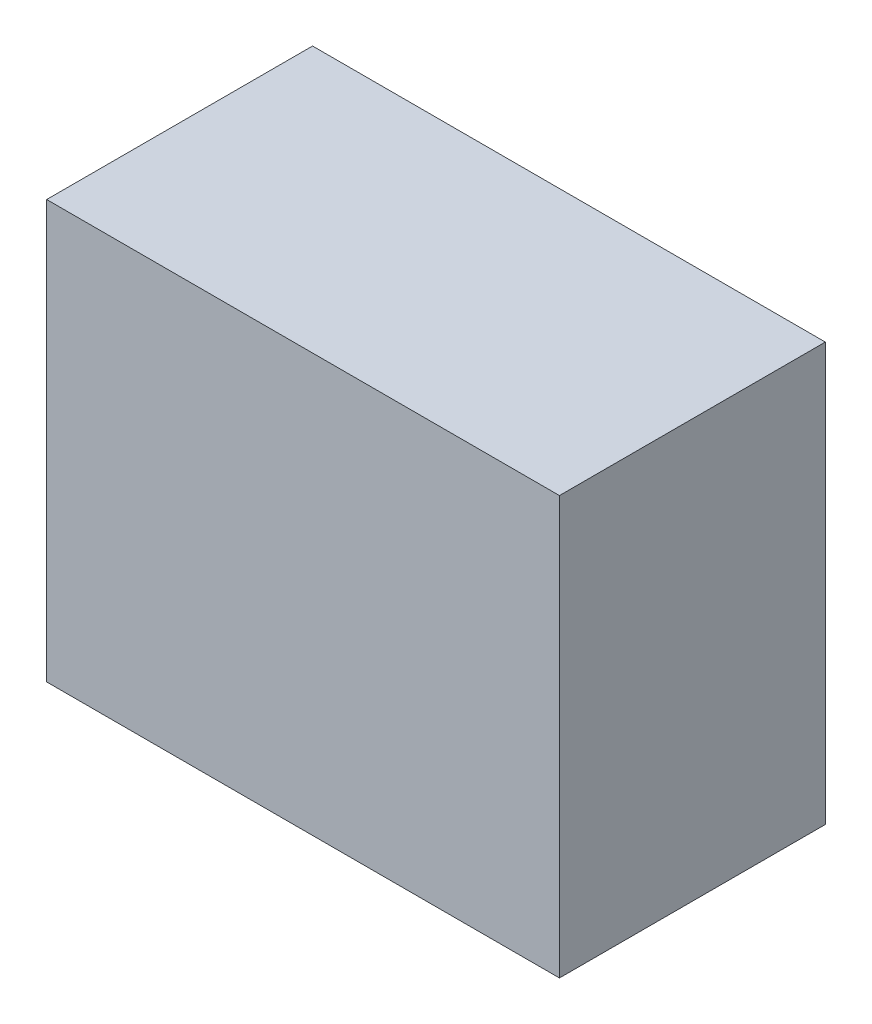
ISO-10303-21;
HEADER;
FILE_DESCRIPTION(('STEP AP214'),'2;1');
FILE_NAME('part.step','',(''),(''),'','','');
FILE_SCHEMA(('AUTOMOTIVE_DESIGN { 1 0 10303 214 1 1 1 1 }'));
ENDSEC;
DATA;
#1=APPLICATION_CONTEXT('core data for automotive mechanical design processes');
#2=APPLICATION_PROTOCOL_DEFINITION('international standard','automotive_design',2000,#1);
#3=PRODUCT_CONTEXT('',#1,'mechanical');
#4=PRODUCT('Part','Part','',(#3));
#5=PRODUCT_RELATED_PRODUCT_CATEGORY('part','',(#4));
#6=PRODUCT_DEFINITION_FORMATION('','',#4);
#7=PRODUCT_DEFINITION_CONTEXT('part definition',#1,'design');
#8=PRODUCT_DEFINITION('design','',#6,#7);
#9=PRODUCT_DEFINITION_SHAPE('','',#8);
#10=(LENGTH_UNIT() NAMED_UNIT(*) SI_UNIT(.MILLI.,.METRE.));
#11=(NAMED_UNIT(*) PLANE_ANGLE_UNIT() SI_UNIT($,.RADIAN.));
#12=(NAMED_UNIT(*) SI_UNIT($,.STERADIAN.) SOLID_ANGLE_UNIT());
#13=UNCERTAINTY_MEASURE_WITH_UNIT(LENGTH_MEASURE(1.E-05),#10,'distance_accuracy_value','');
#14=(GEOMETRIC_REPRESENTATION_CONTEXT(3) GLOBAL_UNCERTAINTY_ASSIGNED_CONTEXT((#13)) GLOBAL_UNIT_ASSIGNED_CONTEXT((#10,
#11,#12)) REPRESENTATION_CONTEXT('',''));
#15=CARTESIAN_POINT('',(0.,0.,0.));
#16=DIRECTION('',(0.,0.,1.));
#17=DIRECTION('',(1.,0.,0.));
#18=AXIS2_PLACEMENT_3D('',#15,#16,#17);
#19=CARTESIAN_POINT('',(0.,0.,1.39999974));
#20=DIRECTION('',(0.,0.,-1.));
#21=DIRECTION('',(0.,-1.,0.));
#22=AXIS2_PLACEMENT_3D('',#19,#20,#21);
#23=PLANE('',#22);
#24=DIRECTION('',(0.,1.,0.));
#25=VECTOR('',#24,1.);
#26=CARTESIAN_POINT('',(-1.34999984,-1.10000034,1.39999974));
#27=LINE('',#26,#25);
#28=CARTESIAN_POINT('',(-1.34999984,-1.10000034,1.39999974));
#29=VERTEX_POINT('',#28);
#30=CARTESIAN_POINT('',(-1.34999984,1.10000034,1.39999974));
#31=VERTEX_POINT('',#30);
#32=EDGE_CURVE('E26',#29,#31,#27,.T.);
#33=ORIENTED_EDGE('',*,*,#32,.F.);
#34=DIRECTION('',(-1.,0.,0.));
#35=VECTOR('',#34,1.);
#36=CARTESIAN_POINT('',(1.34999984,-1.10000034,1.39999974));
#37=LINE('',#36,#35);
#38=CARTESIAN_POINT('',(1.34999984,-1.10000034,1.39999974));
#39=VERTEX_POINT('',#38);
#40=EDGE_CURVE('E58',#39,#29,#37,.T.);
#41=ORIENTED_EDGE('',*,*,#40,.F.);
#42=DIRECTION('',(0.,-1.,0.));
#43=VECTOR('',#42,1.);
#44=CARTESIAN_POINT('',(1.34999984,1.10000034,1.39999974));
#45=LINE('',#44,#43);
#46=CARTESIAN_POINT('',(1.34999984,1.10000034,1.39999974));
#47=VERTEX_POINT('',#46);
#48=EDGE_CURVE('E74',#47,#39,#45,.T.);
#49=ORIENTED_EDGE('',*,*,#48,.F.);
#50=DIRECTION('',(1.,0.,0.));
#51=VECTOR('',#50,1.);
#52=CARTESIAN_POINT('',(-1.34999984,1.10000034,1.39999974));
#53=LINE('',#52,#51);
#54=EDGE_CURVE('E97',#31,#47,#53,.T.);
#55=ORIENTED_EDGE('',*,*,#54,.F.);
#56=EDGE_LOOP('',(#33,#41,#49,#55));
#57=FACE_BOUND('',#56,.T.);
#58=ADVANCED_FACE('F17',(#57),#23,.F.);
#59=CARTESIAN_POINT('',(0.,0.,0.));
#60=DIRECTION('',(0.,0.,-1.));
#61=DIRECTION('',(0.,-1.,0.));
#62=AXIS2_PLACEMENT_3D('',#59,#60,#61);
#63=PLANE('',#62);
#64=DIRECTION('',(1.,0.,0.));
#65=VECTOR('',#64,1.);
#66=CARTESIAN_POINT('',(-1.34999984,1.10000034,0.));
#67=LINE('',#66,#65);
#68=CARTESIAN_POINT('',(-1.34999984,1.10000034,0.));
#69=VERTEX_POINT('',#68);
#70=CARTESIAN_POINT('',(1.34999984,1.10000034,0.));
#71=VERTEX_POINT('',#70);
#72=EDGE_CURVE('E83',#69,#71,#67,.T.);
#73=ORIENTED_EDGE('',*,*,#72,.T.);
#74=DIRECTION('',(0.,-1.,0.));
#75=VECTOR('',#74,1.);
#76=CARTESIAN_POINT('',(1.34999984,1.10000034,0.));
#77=LINE('',#76,#75);
#78=CARTESIAN_POINT('',(1.34999984,-1.10000034,0.));
#79=VERTEX_POINT('',#78);
#80=EDGE_CURVE('E68',#71,#79,#77,.T.);
#81=ORIENTED_EDGE('',*,*,#80,.T.);
#82=DIRECTION('',(-1.,0.,0.));
#83=VECTOR('',#82,1.);
#84=CARTESIAN_POINT('',(1.34999984,-1.10000034,0.));
#85=LINE('',#84,#83);
#86=CARTESIAN_POINT('',(-1.34999984,-1.10000034,0.));
#87=VERTEX_POINT('',#86);
#88=EDGE_CURVE('E85',#79,#87,#85,.T.);
#89=ORIENTED_EDGE('',*,*,#88,.T.);
#90=DIRECTION('',(0.,1.,0.));
#91=VECTOR('',#90,1.);
#92=CARTESIAN_POINT('',(-1.34999984,-1.10000034,0.));
#93=LINE('',#92,#91);
#94=EDGE_CURVE('E11',#87,#69,#93,.T.);
#95=ORIENTED_EDGE('',*,*,#94,.T.);
#96=EDGE_LOOP('',(#73,#81,#89,#95));
#97=FACE_BOUND('',#96,.T.);
#98=ADVANCED_FACE('F19',(#97),#63,.T.);
#99=CARTESIAN_POINT('',(-1.34999984,-1.10000034,0.));
#100=DIRECTION('',(-1.,0.,0.));
#101=DIRECTION('',(0.,0.,1.));
#102=AXIS2_PLACEMENT_3D('',#99,#100,#101);
#103=PLANE('',#102);
#104=DIRECTION('',(0.,0.,1.));
#105=VECTOR('',#104,1.);
#106=CARTESIAN_POINT('',(-1.34999984,-1.10000034,0.));
#107=LINE('',#106,#105);
#108=EDGE_CURVE('E110',#87,#29,#107,.T.);
#109=ORIENTED_EDGE('',*,*,#108,.T.);
#110=ORIENTED_EDGE('',*,*,#32,.T.);
#111=DIRECTION('',(0.,0.,1.));
#112=VECTOR('',#111,1.);
#113=CARTESIAN_POINT('',(-1.34999984,1.10000034,0.));
#114=LINE('',#113,#112);
#115=EDGE_CURVE('E91',#69,#31,#114,.T.);
#116=ORIENTED_EDGE('',*,*,#115,.F.);
#117=ORIENTED_EDGE('',*,*,#94,.F.);
#118=EDGE_LOOP('',(#109,#110,#116,#117));
#119=FACE_BOUND('',#118,.T.);
#120=ADVANCED_FACE('F95',(#119),#103,.T.);
#121=CARTESIAN_POINT('',(1.34999984,-1.10000034,0.));
#122=DIRECTION('',(0.,-1.,0.));
#123=DIRECTION('',(0.,0.,-1.));
#124=AXIS2_PLACEMENT_3D('',#121,#122,#123);
#125=PLANE('',#124);
#126=DIRECTION('',(0.,0.,1.));
#127=VECTOR('',#126,1.);
#128=CARTESIAN_POINT('',(1.34999984,-1.10000034,0.));
#129=LINE('',#128,#127);
#130=EDGE_CURVE('E113',#79,#39,#129,.T.);
#131=ORIENTED_EDGE('',*,*,#130,.T.);
#132=ORIENTED_EDGE('',*,*,#40,.T.);
#133=ORIENTED_EDGE('',*,*,#108,.F.);
#134=ORIENTED_EDGE('',*,*,#88,.F.);
#135=EDGE_LOOP('',(#131,#132,#133,#134));
#136=FACE_BOUND('',#135,.T.);
#137=ADVANCED_FACE('F159',(#136),#125,.T.);
#138=CARTESIAN_POINT('',(1.34999984,1.10000034,0.));
#139=DIRECTION('',(1.,0.,0.));
#140=DIRECTION('',(0.,1.,0.));
#141=AXIS2_PLACEMENT_3D('',#138,#139,#140);
#142=PLANE('',#141);
#143=DIRECTION('',(0.,0.,1.));
#144=VECTOR('',#143,1.);
#145=CARTESIAN_POINT('',(1.34999984,1.10000034,0.));
#146=LINE('',#145,#144);
#147=EDGE_CURVE('E92',#71,#47,#146,.T.);
#148=ORIENTED_EDGE('',*,*,#147,.T.);
#149=ORIENTED_EDGE('',*,*,#48,.T.);
#150=ORIENTED_EDGE('',*,*,#130,.F.);
#151=ORIENTED_EDGE('',*,*,#80,.F.);
#152=EDGE_LOOP('',(#148,#149,#150,#151));
#153=FACE_BOUND('',#152,.T.);
#154=ADVANCED_FACE('F160',(#153),#142,.T.);
#155=CARTESIAN_POINT('',(-1.34999984,1.10000034,0.));
#156=DIRECTION('',(0.,1.,0.));
#157=DIRECTION('',(1.,0.,0.));
#158=AXIS2_PLACEMENT_3D('',#155,#156,#157);
#159=PLANE('',#158);
#160=ORIENTED_EDGE('',*,*,#115,.T.);
#161=ORIENTED_EDGE('',*,*,#54,.T.);
#162=ORIENTED_EDGE('',*,*,#147,.F.);
#163=ORIENTED_EDGE('',*,*,#72,.F.);
#164=EDGE_LOOP('',(#160,#161,#162,#163));
#165=FACE_BOUND('',#164,.T.);
#166=ADVANCED_FACE('F89',(#165),#159,.T.);
#167=CLOSED_SHELL('',(#58,#98,#120,#137,#154,#166));
#168=MANIFOLD_SOLID_BREP('B1',#167);
#169=ADVANCED_BREP_SHAPE_REPRESENTATION('',(#18,#168),#14);
#170=SHAPE_DEFINITION_REPRESENTATION(#9,#169);
ENDSEC;
END-ISO-10303-21;
